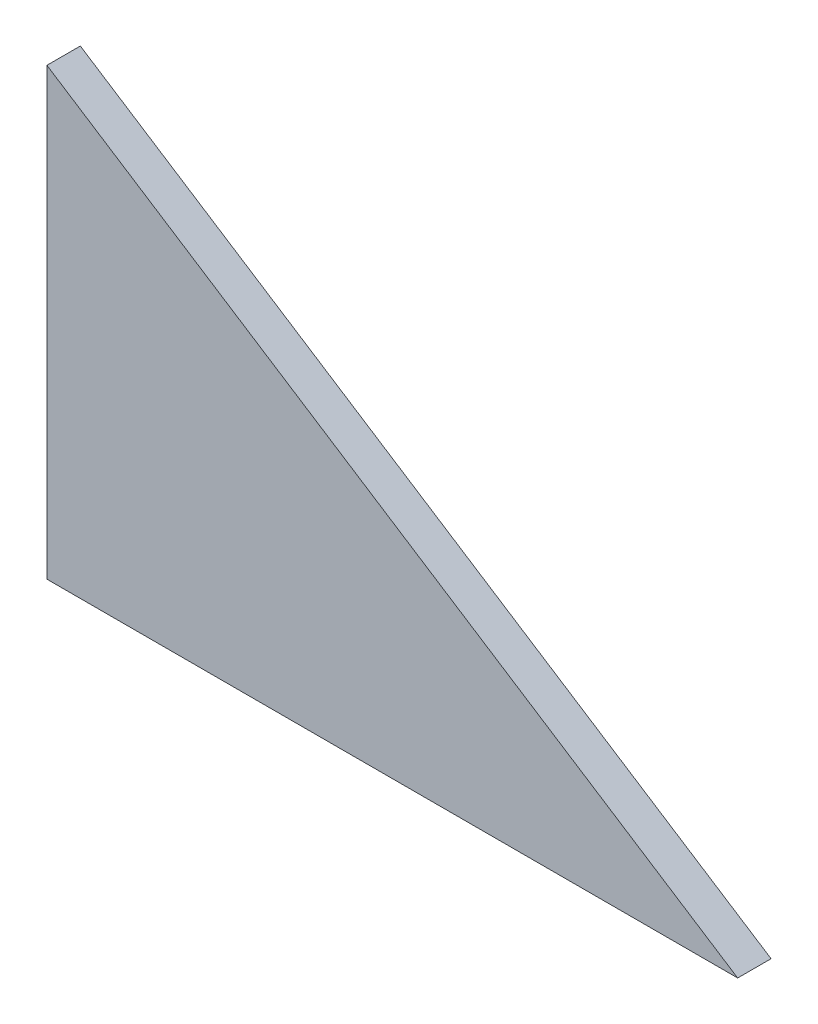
from build123d import *

# Parameters (mm, degrees)
BOSS_EXTRUDE1_DEPTH = 6


with BuildPart() as part:
    # Sketch1 → Boss-Extrude1 (new body)
    with BuildSketch(Plane.XY):
        Polygon((-49.842243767, -29.389736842), (74.247756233, -29.389736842), (-49.842243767, 50.560263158), align=None)
    extrude(amount=BOSS_EXTRUDE1_DEPTH)


solid = part.part
